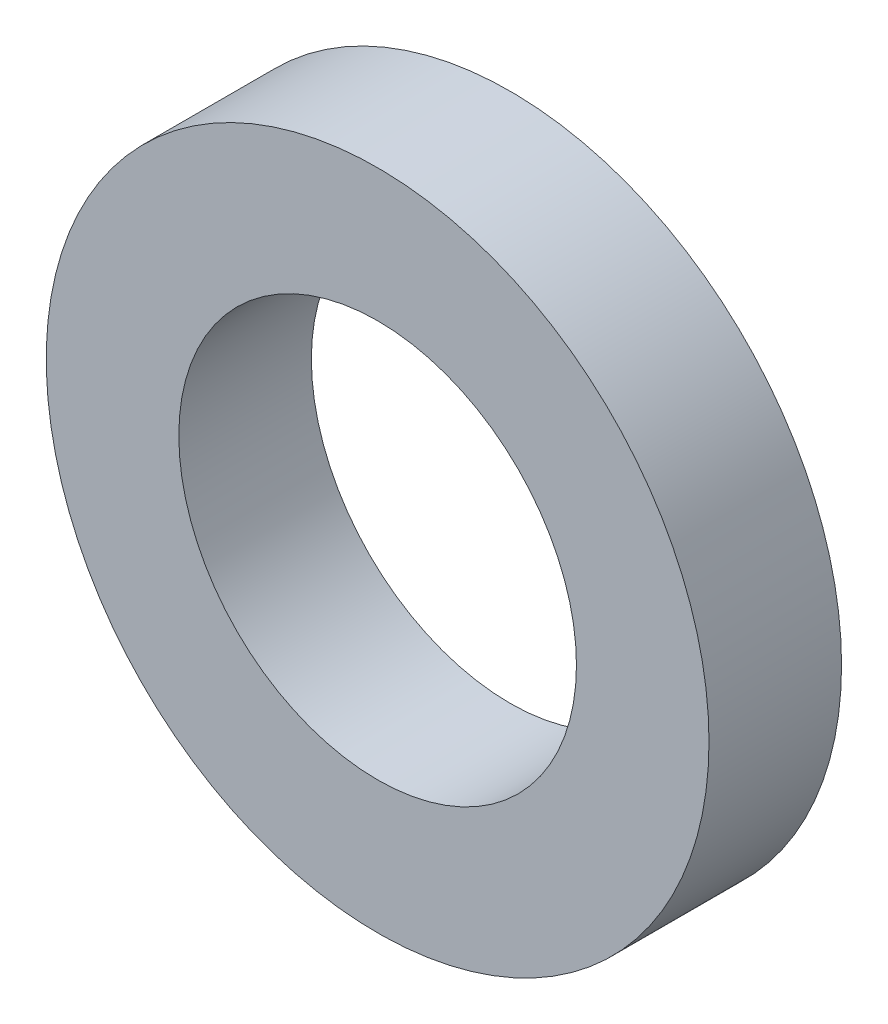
from build123d import *

# Parameters (mm, degrees)
SKETCH1_W = 1
SKETCH1_H = 1


with BuildPart() as part:
    # Sketch1 → Revolve1 (revolve)
    with BuildSketch(Plane(origin=(0, 0, 0), x_dir=(1, 0, 0), z_dir=(0, 1, 0))):
        with Locations((2, 0.135)):
            Rectangle(SKETCH1_W, SKETCH1_H)
    revolve(axis=Axis((0, 0, 0.635), (0, 0, -1)))


solid = part.part
